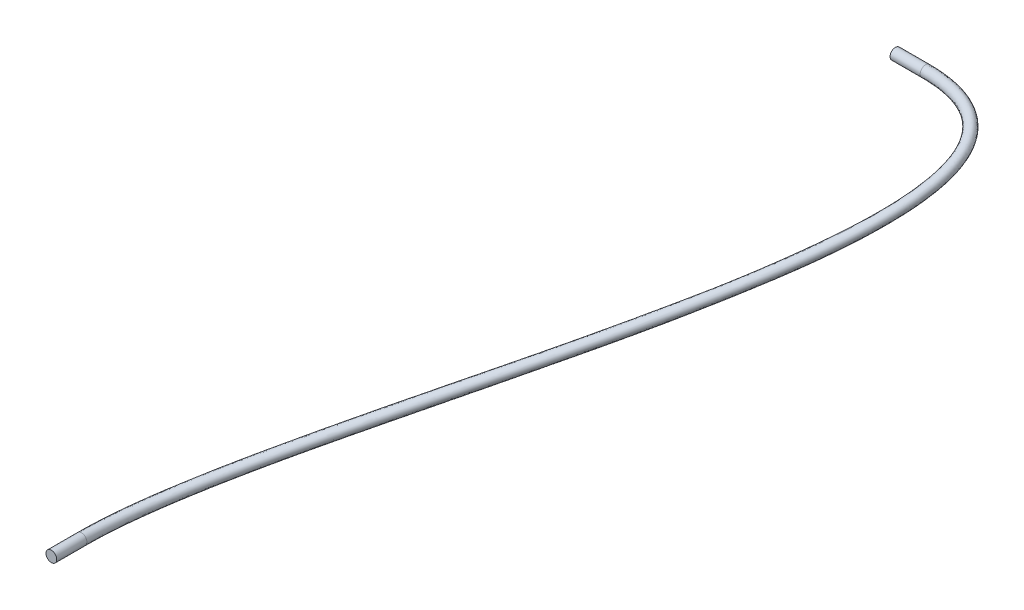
ISO-10303-21;
HEADER;
FILE_DESCRIPTION(('STEP AP214'),'2;1');
FILE_NAME('part.step','',(''),(''),'','','');
FILE_SCHEMA(('AUTOMOTIVE_DESIGN { 1 0 10303 214 1 1 1 1 }'));
ENDSEC;
DATA;
#1=APPLICATION_CONTEXT('core data for automotive mechanical design processes');
#2=APPLICATION_PROTOCOL_DEFINITION('international standard','automotive_design',2000,#1);
#3=PRODUCT_CONTEXT('',#1,'mechanical');
#4=PRODUCT('Part','Part','',(#3));
#5=PRODUCT_RELATED_PRODUCT_CATEGORY('part','',(#4));
#6=PRODUCT_DEFINITION_FORMATION('','',#4);
#7=PRODUCT_DEFINITION_CONTEXT('part definition',#1,'design');
#8=PRODUCT_DEFINITION('design','',#6,#7);
#9=PRODUCT_DEFINITION_SHAPE('','',#8);
#10=(LENGTH_UNIT() NAMED_UNIT(*) SI_UNIT(.MILLI.,.METRE.));
#11=(NAMED_UNIT(*) PLANE_ANGLE_UNIT() SI_UNIT($,.RADIAN.));
#12=(NAMED_UNIT(*) SI_UNIT($,.STERADIAN.) SOLID_ANGLE_UNIT());
#13=UNCERTAINTY_MEASURE_WITH_UNIT(LENGTH_MEASURE(1.E-05),#10,'distance_accuracy_value','');
#14=(GEOMETRIC_REPRESENTATION_CONTEXT(3) GLOBAL_UNCERTAINTY_ASSIGNED_CONTEXT((#13)) GLOBAL_UNIT_ASSIGNED_CONTEXT((#10,
#11,#12)) REPRESENTATION_CONTEXT('',''));
#15=CARTESIAN_POINT('',(0.,0.,0.));
#16=DIRECTION('',(0.,0.,1.));
#17=DIRECTION('',(1.,0.,0.));
#18=AXIS2_PLACEMENT_3D('',#15,#16,#17);
#19=CARTESIAN_POINT('',(-123.012022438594,-71.2232339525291,-87.4315353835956));
#20=DIRECTION('',(-1.,0.,0.));
#21=DIRECTION('',(0.,0.,1.));
#22=AXIS2_PLACEMENT_3D('',#19,#20,#21);
#23=CYLINDRICAL_SURFACE('',#22,1.25);
#24=CARTESIAN_POINT('',(-123.012022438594,-71.2232339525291,-87.4315353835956));
#25=DIRECTION('',(-1.,0.,0.));
#26=DIRECTION('',(0.,0.282310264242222,-0.959323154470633));
#27=AXIS2_PLACEMENT_3D('',#24,#25,#26);
#28=CIRCLE('',#27,1.25);
#29=CARTESIAN_POINT('',(-123.012022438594,-71.2232339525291,-86.1815353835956));
#30=VERTEX_POINT('',#29);
#31=EDGE_CURVE('E62',#30,#30,#28,.T.);
#32=CARTESIAN_POINT('',(-130.012022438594,-71.2232339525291,-87.4315353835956));
#33=DIRECTION('',(-1.,0.,0.));
#34=DIRECTION('',(0.,0.282310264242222,-0.959323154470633));
#35=AXIS2_PLACEMENT_3D('',#32,#33,#34);
#36=CIRCLE('',#35,1.25);
#37=CARTESIAN_POINT('',(-130.012022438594,-71.2232339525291,-86.1815353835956));
#38=VERTEX_POINT('',#37);
#39=EDGE_CURVE('E11',#38,#38,#36,.T.);
#40=CARTESIAN_POINT('',(-123.012022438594,-71.2232339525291,-86.1815353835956));
#41=CARTESIAN_POINT('',(-123.084939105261,-71.2232339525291,-86.1815353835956));
#42=CARTESIAN_POINT('',(-123.157855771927,-71.2232339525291,-86.1815353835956));
#43=CARTESIAN_POINT('',(-123.303689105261,-71.2232339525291,-86.1815353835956));
#44=CARTESIAN_POINT('',(-123.376605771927,-71.2232339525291,-86.1815353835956));
#45=CARTESIAN_POINT('',(-123.522439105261,-71.2232339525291,-86.1815353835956));
#46=CARTESIAN_POINT('',(-123.595355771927,-71.2232339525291,-86.1815353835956));
#47=CARTESIAN_POINT('',(-123.741189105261,-71.2232339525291,-86.1815353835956));
#48=CARTESIAN_POINT('',(-123.814105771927,-71.2232339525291,-86.1815353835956));
#49=CARTESIAN_POINT('',(-123.959939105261,-71.2232339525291,-86.1815353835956));
#50=CARTESIAN_POINT('',(-124.032855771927,-71.2232339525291,-86.1815353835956));
#51=CARTESIAN_POINT('',(-124.178689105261,-71.2232339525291,-86.1815353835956));
#52=CARTESIAN_POINT('',(-124.251605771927,-71.2232339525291,-86.1815353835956));
#53=CARTESIAN_POINT('',(-124.397439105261,-71.2232339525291,-86.1815353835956));
#54=CARTESIAN_POINT('',(-124.470355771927,-71.2232339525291,-86.1815353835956));
#55=CARTESIAN_POINT('',(-124.616189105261,-71.2232339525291,-86.1815353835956));
#56=CARTESIAN_POINT('',(-124.689105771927,-71.2232339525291,-86.1815353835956));
#57=CARTESIAN_POINT('',(-124.834939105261,-71.2232339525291,-86.1815353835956));
#58=CARTESIAN_POINT('',(-124.907855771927,-71.2232339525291,-86.1815353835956));
#59=CARTESIAN_POINT('',(-125.053689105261,-71.2232339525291,-86.1815353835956));
#60=CARTESIAN_POINT('',(-125.126605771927,-71.2232339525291,-86.1815353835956));
#61=CARTESIAN_POINT('',(-125.272439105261,-71.2232339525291,-86.1815353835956));
#62=CARTESIAN_POINT('',(-125.345355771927,-71.2232339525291,-86.1815353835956));
#63=CARTESIAN_POINT('',(-125.491189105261,-71.2232339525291,-86.1815353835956));
#64=CARTESIAN_POINT('',(-125.564105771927,-71.2232339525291,-86.1815353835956));
#65=CARTESIAN_POINT('',(-125.709939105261,-71.2232339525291,-86.1815353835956));
#66=CARTESIAN_POINT('',(-125.782855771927,-71.2232339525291,-86.1815353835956));
#67=CARTESIAN_POINT('',(-125.928689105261,-71.2232339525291,-86.1815353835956));
#68=CARTESIAN_POINT('',(-126.001605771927,-71.2232339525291,-86.1815353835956));
#69=CARTESIAN_POINT('',(-126.147439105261,-71.2232339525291,-86.1815353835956));
#70=CARTESIAN_POINT('',(-126.220355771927,-71.2232339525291,-86.1815353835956));
#71=CARTESIAN_POINT('',(-126.366189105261,-71.2232339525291,-86.1815353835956));
#72=CARTESIAN_POINT('',(-126.439105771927,-71.2232339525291,-86.1815353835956));
#73=CARTESIAN_POINT('',(-126.584939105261,-71.2232339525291,-86.1815353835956));
#74=CARTESIAN_POINT('',(-126.657855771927,-71.2232339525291,-86.1815353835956));
#75=CARTESIAN_POINT('',(-126.803689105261,-71.2232339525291,-86.1815353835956));
#76=CARTESIAN_POINT('',(-126.876605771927,-71.2232339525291,-86.1815353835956));
#77=CARTESIAN_POINT('',(-127.022439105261,-71.2232339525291,-86.1815353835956));
#78=CARTESIAN_POINT('',(-127.095355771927,-71.2232339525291,-86.1815353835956));
#79=CARTESIAN_POINT('',(-127.241189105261,-71.2232339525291,-86.1815353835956));
#80=CARTESIAN_POINT('',(-127.314105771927,-71.2232339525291,-86.1815353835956));
#81=CARTESIAN_POINT('',(-127.459939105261,-71.2232339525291,-86.1815353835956));
#82=CARTESIAN_POINT('',(-127.532855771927,-71.2232339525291,-86.1815353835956));
#83=CARTESIAN_POINT('',(-127.678689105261,-71.2232339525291,-86.1815353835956));
#84=CARTESIAN_POINT('',(-127.751605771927,-71.2232339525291,-86.1815353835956));
#85=CARTESIAN_POINT('',(-127.897439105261,-71.2232339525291,-86.1815353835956));
#86=CARTESIAN_POINT('',(-127.970355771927,-71.2232339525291,-86.1815353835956));
#87=CARTESIAN_POINT('',(-128.116189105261,-71.2232339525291,-86.1815353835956));
#88=CARTESIAN_POINT('',(-128.189105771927,-71.2232339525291,-86.1815353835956));
#89=CARTESIAN_POINT('',(-128.334939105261,-71.2232339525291,-86.1815353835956));
#90=CARTESIAN_POINT('',(-128.407855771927,-71.2232339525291,-86.1815353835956));
#91=CARTESIAN_POINT('',(-128.553689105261,-71.2232339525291,-86.1815353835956));
#92=CARTESIAN_POINT('',(-128.626605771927,-71.2232339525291,-86.1815353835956));
#93=CARTESIAN_POINT('',(-128.772439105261,-71.2232339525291,-86.1815353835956));
#94=CARTESIAN_POINT('',(-128.845355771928,-71.2232339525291,-86.1815353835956));
#95=CARTESIAN_POINT('',(-128.991189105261,-71.2232339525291,-86.1815353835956));
#96=CARTESIAN_POINT('',(-129.064105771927,-71.2232339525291,-86.1815353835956));
#97=CARTESIAN_POINT('',(-129.209939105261,-71.2232339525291,-86.1815353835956));
#98=CARTESIAN_POINT('',(-129.282855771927,-71.2232339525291,-86.1815353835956));
#99=CARTESIAN_POINT('',(-129.428689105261,-71.2232339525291,-86.1815353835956));
#100=CARTESIAN_POINT('',(-129.501605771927,-71.2232339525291,-86.1815353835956));
#101=CARTESIAN_POINT('',(-129.647439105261,-71.2232339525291,-86.1815353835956));
#102=CARTESIAN_POINT('',(-129.720355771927,-71.2232339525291,-86.1815353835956));
#103=CARTESIAN_POINT('',(-129.866189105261,-71.2232339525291,-86.1815353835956));
#104=CARTESIAN_POINT('',(-129.939105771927,-71.2232339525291,-86.1815353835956));
#105=CARTESIAN_POINT('',(-130.012022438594,-71.2232339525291,-86.1815353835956));
#106=B_SPLINE_CURVE_WITH_KNOTS('',3,(#40,#41,#42,#43,#44,#45,#46,#47,#48,#49,#50,#51,#52,#53,
#54,#55,#56,#57,#58,#59,#60,#61,#62,#63,#64,#65,#66,#67,#68,#69,#70,#71,#72,#73,#74,#75,#76,#77,
#78,#79,#80,#81,#82,#83,#84,#85,#86,#87,#88,#89,#90,#91,#92,#93,#94,#95,#96,#97,#98,#99,#100,
#101,#102,#103,#104,#105),.UNSPECIFIED.,.F.,.F.,(4,2,2,2,2,2,2,2,2,2,2,2,2,2,2,2,2,2,2,2,2,2,2,
2,2,2,2,2,2,2,2,2,4),(0.,0.218750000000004,0.437500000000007,0.656250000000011,
0.875000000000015,1.09375,1.31250000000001,1.53125000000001,1.75000000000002,1.96875000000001,
2.18750000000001,2.40625,2.62500000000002,2.84375000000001,3.06250000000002,3.28125000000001,
3.5,3.71875000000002,3.93750000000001,4.15625,4.37500000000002,4.59375000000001,
4.81250000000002,5.03125000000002,5.25,5.46875000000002,5.68750000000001,5.90625000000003,
6.12500000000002,6.34375000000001,6.56250000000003,6.78125000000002,7.00000000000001),.UNSPECIFIED.);
#107=EDGE_CURVE('BSEAM47',#30,#38,#106,.T.);
#108=ORIENTED_EDGE('',*,*,#31,.T.);
#109=ORIENTED_EDGE('',*,*,#39,.F.);
#110=ORIENTED_EDGE('',*,*,#107,.T.);
#111=ORIENTED_EDGE('',*,*,#107,.F.);
#112=EDGE_LOOP('',(#108,#110,#109,#111));
#113=FACE_BOUND('',#112,.T.);
#114=ADVANCED_FACE('F47',(#113),#23,.T.);
#115=CARTESIAN_POINT('',(-193.889525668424,-138.225033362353,37.6644646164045));
#116=DIRECTION('',(0.,0.,1.));
#117=DIRECTION('',(1.,0.,0.));
#118=AXIS2_PLACEMENT_3D('',#115,#116,#117);
#119=CYLINDRICAL_SURFACE('',#118,1.25);
#120=CARTESIAN_POINT('',(-193.889525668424,-138.225033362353,37.6644646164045));
#121=DIRECTION('',(0.,0.,-1.));
#122=DIRECTION('',(-1.,0.,0.));
#123=AXIS2_PLACEMENT_3D('',#120,#121,#122);
#124=CIRCLE('',#123,1.25);
#125=CARTESIAN_POINT('',(-192.639525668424,-138.225033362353,37.6644646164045));
#126=VERTEX_POINT('',#125);
#127=EDGE_CURVE('E53',#126,#126,#124,.T.);
#128=CARTESIAN_POINT('',(-193.889525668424,-138.225033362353,44.6644646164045));
#129=DIRECTION('',(0.,0.,-1.));
#130=DIRECTION('',(-1.,0.,0.));
#131=AXIS2_PLACEMENT_3D('',#128,#129,#130);
#132=CIRCLE('',#131,1.25);
#133=CARTESIAN_POINT('',(-192.639525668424,-138.225033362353,44.6644646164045));
#134=VERTEX_POINT('',#133);
#135=EDGE_CURVE('E57',#134,#134,#132,.T.);
#136=CARTESIAN_POINT('',(-192.639525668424,-138.225033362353,37.6644646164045));
#137=CARTESIAN_POINT('',(-192.639525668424,-138.225033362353,37.7373812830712));
#138=CARTESIAN_POINT('',(-192.639525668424,-138.225033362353,37.8102979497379));
#139=CARTESIAN_POINT('',(-192.639525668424,-138.225033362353,37.9561312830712));
#140=CARTESIAN_POINT('',(-192.639525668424,-138.225033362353,38.0290479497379));
#141=CARTESIAN_POINT('',(-192.639525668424,-138.225033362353,38.1748812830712));
#142=CARTESIAN_POINT('',(-192.639525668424,-138.225033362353,38.2477979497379));
#143=CARTESIAN_POINT('',(-192.639525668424,-138.225033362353,38.3936312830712));
#144=CARTESIAN_POINT('',(-192.639525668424,-138.225033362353,38.4665479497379));
#145=CARTESIAN_POINT('',(-192.639525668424,-138.225033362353,38.6123812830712));
#146=CARTESIAN_POINT('',(-192.639525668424,-138.225033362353,38.6852979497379));
#147=CARTESIAN_POINT('',(-192.639525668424,-138.225033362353,38.8311312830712));
#148=CARTESIAN_POINT('',(-192.639525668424,-138.225033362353,38.9040479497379));
#149=CARTESIAN_POINT('',(-192.639525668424,-138.225033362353,39.0498812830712));
#150=CARTESIAN_POINT('',(-192.639525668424,-138.225033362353,39.1227979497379));
#151=CARTESIAN_POINT('',(-192.639525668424,-138.225033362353,39.2686312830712));
#152=CARTESIAN_POINT('',(-192.639525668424,-138.225033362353,39.3415479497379));
#153=CARTESIAN_POINT('',(-192.639525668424,-138.225033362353,39.4873812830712));
#154=CARTESIAN_POINT('',(-192.639525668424,-138.225033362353,39.5602979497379));
#155=CARTESIAN_POINT('',(-192.639525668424,-138.225033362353,39.7061312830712));
#156=CARTESIAN_POINT('',(-192.639525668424,-138.225033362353,39.7790479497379));
#157=CARTESIAN_POINT('',(-192.639525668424,-138.225033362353,39.9248812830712));
#158=CARTESIAN_POINT('',(-192.639525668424,-138.225033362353,39.9977979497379));
#159=CARTESIAN_POINT('',(-192.639525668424,-138.225033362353,40.1436312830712));
#160=CARTESIAN_POINT('',(-192.639525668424,-138.225033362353,40.2165479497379));
#161=CARTESIAN_POINT('',(-192.639525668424,-138.225033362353,40.3623812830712));
#162=CARTESIAN_POINT('',(-192.639525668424,-138.225033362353,40.4352979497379));
#163=CARTESIAN_POINT('',(-192.639525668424,-138.225033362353,40.5811312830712));
#164=CARTESIAN_POINT('',(-192.639525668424,-138.225033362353,40.6540479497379));
#165=CARTESIAN_POINT('',(-192.639525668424,-138.225033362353,40.7998812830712));
#166=CARTESIAN_POINT('',(-192.639525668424,-138.225033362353,40.8727979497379));
#167=CARTESIAN_POINT('',(-192.639525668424,-138.225033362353,41.0186312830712));
#168=CARTESIAN_POINT('',(-192.639525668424,-138.225033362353,41.0915479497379));
#169=CARTESIAN_POINT('',(-192.639525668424,-138.225033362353,41.2373812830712));
#170=CARTESIAN_POINT('',(-192.639525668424,-138.225033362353,41.3102979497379));
#171=CARTESIAN_POINT('',(-192.639525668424,-138.225033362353,41.4561312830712));
#172=CARTESIAN_POINT('',(-192.639525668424,-138.225033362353,41.5290479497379));
#173=CARTESIAN_POINT('',(-192.639525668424,-138.225033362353,41.6748812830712));
#174=CARTESIAN_POINT('',(-192.639525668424,-138.225033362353,41.7477979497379));
#175=CARTESIAN_POINT('',(-192.639525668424,-138.225033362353,41.8936312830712));
#176=CARTESIAN_POINT('',(-192.639525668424,-138.225033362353,41.9665479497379));
#177=CARTESIAN_POINT('',(-192.639525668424,-138.225033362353,42.1123812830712));
#178=CARTESIAN_POINT('',(-192.639525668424,-138.225033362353,42.1852979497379));
#179=CARTESIAN_POINT('',(-192.639525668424,-138.225033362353,42.3311312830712));
#180=CARTESIAN_POINT('',(-192.639525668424,-138.225033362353,42.4040479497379));
#181=CARTESIAN_POINT('',(-192.639525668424,-138.225033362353,42.5498812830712));
#182=CARTESIAN_POINT('',(-192.639525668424,-138.225033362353,42.6227979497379));
#183=CARTESIAN_POINT('',(-192.639525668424,-138.225033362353,42.7686312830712));
#184=CARTESIAN_POINT('',(-192.639525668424,-138.225033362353,42.8415479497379));
#185=CARTESIAN_POINT('',(-192.639525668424,-138.225033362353,42.9873812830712));
#186=CARTESIAN_POINT('',(-192.639525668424,-138.225033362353,43.0602979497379));
#187=CARTESIAN_POINT('',(-192.639525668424,-138.225033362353,43.2061312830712));
#188=CARTESIAN_POINT('',(-192.639525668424,-138.225033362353,43.2790479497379));
#189=CARTESIAN_POINT('',(-192.639525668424,-138.225033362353,43.4248812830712));
#190=CARTESIAN_POINT('',(-192.639525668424,-138.225033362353,43.4977979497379));
#191=CARTESIAN_POINT('',(-192.639525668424,-138.225033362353,43.6436312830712));
#192=CARTESIAN_POINT('',(-192.639525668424,-138.225033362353,43.7165479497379));
#193=CARTESIAN_POINT('',(-192.639525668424,-138.225033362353,43.8623812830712));
#194=CARTESIAN_POINT('',(-192.639525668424,-138.225033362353,43.9352979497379));
#195=CARTESIAN_POINT('',(-192.639525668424,-138.225033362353,44.0811312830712));
#196=CARTESIAN_POINT('',(-192.639525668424,-138.225033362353,44.1540479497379));
#197=CARTESIAN_POINT('',(-192.639525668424,-138.225033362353,44.2998812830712));
#198=CARTESIAN_POINT('',(-192.639525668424,-138.225033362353,44.3727979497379));
#199=CARTESIAN_POINT('',(-192.639525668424,-138.225033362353,44.5186312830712));
#200=CARTESIAN_POINT('',(-192.639525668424,-138.225033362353,44.5915479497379));
#201=CARTESIAN_POINT('',(-192.639525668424,-138.225033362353,44.6644646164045));
#202=B_SPLINE_CURVE_WITH_KNOTS('',3,(#136,#137,#138,#139,#140,#141,#142,#143,#144,#145,#146,
#147,#148,#149,#150,#151,#152,#153,#154,#155,#156,#157,#158,#159,#160,#161,#162,#163,#164,#165,
#166,#167,#168,#169,#170,#171,#172,#173,#174,#175,#176,#177,#178,#179,#180,#181,#182,#183,#184,
#185,#186,#187,#188,#189,#190,#191,#192,#193,#194,#195,#196,#197,#198,#199,#200,#201),
.UNSPECIFIED.,.F.,.F.,(4,2,2,2,2,2,2,2,2,2,2,2,2,2,2,2,2,2,2,2,2,2,2,2,2,2,2,2,2,2,2,2,4),(0.,
0.218750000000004,0.4375,0.656250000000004,0.875000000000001,1.09375,1.3125,1.53125,1.75,
1.96875000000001,2.1875,2.40625000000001,2.625,2.84375000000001,3.0625,3.28125,3.5,3.71875,
3.9375,4.15625,4.375,4.59375,4.8125,5.03125,5.25,5.46875,5.68750000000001,5.90625,
6.12500000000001,6.34375,6.5625,6.78125,7.),.UNSPECIFIED.);
#203=EDGE_CURVE('BSEAM81',#126,#134,#202,.T.);
#204=ORIENTED_EDGE('',*,*,#127,.F.);
#205=ORIENTED_EDGE('',*,*,#135,.T.);
#206=ORIENTED_EDGE('',*,*,#203,.T.);
#207=ORIENTED_EDGE('',*,*,#203,.F.);
#208=EDGE_LOOP('',(#204,#206,#205,#207));
#209=FACE_BOUND('',#208,.T.);
#210=ADVANCED_FACE('F81',(#209),#119,.T.);
#211=CARTESIAN_POINT('',(-193.889525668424,-138.225033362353,44.6644646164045));
#212=DIRECTION('',(0.,0.,-1.));
#213=DIRECTION('',(-1.,0.,0.));
#214=AXIS2_PLACEMENT_3D('',#211,#212,#213);
#215=PLANE('',#214);
#216=ORIENTED_EDGE('',*,*,#135,.F.);
#217=EDGE_LOOP('',(#216));
#218=FACE_BOUND('',#217,.T.);
#219=ADVANCED_FACE('F76',(#218),#215,.F.);
#220=CARTESIAN_POINT('',(-130.012022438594,-71.2232339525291,-87.4315353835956));
#221=DIRECTION('',(-1.,0.,0.));
#222=DIRECTION('',(0.,0.282310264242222,-0.959323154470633));
#223=AXIS2_PLACEMENT_3D('',#220,#221,#222);
#224=PLANE('',#223);
#225=ORIENTED_EDGE('',*,*,#39,.T.);
#226=EDGE_LOOP('',(#225));
#227=FACE_BOUND('',#226,.T.);
#228=ADVANCED_FACE('F71',(#227),#224,.T.);
#229=CARTESIAN_POINT('',(-195.139525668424,-138.225033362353,37.6644646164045));
#230=CARTESIAN_POINT('',(-195.139525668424,-138.225033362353,34.7476737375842));
#231=CARTESIAN_POINT('',(-194.406398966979,-137.857630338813,28.505824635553));
#232=CARTESIAN_POINT('',(-191.424791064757,-136.294005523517,19.3451536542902));
#233=CARTESIAN_POINT('',(-186.864834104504,-133.863548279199,10.0822324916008));
#234=CARTESIAN_POINT('',(-176.806733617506,-128.438528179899,-5.71798844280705));
#235=CARTESIAN_POINT('',(-160.553122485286,-119.214977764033,-24.302903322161));
#236=CARTESIAN_POINT('',(-139.915160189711,-107.779324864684,-44.0373880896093));
#237=CARTESIAN_POINT('',(-124.795471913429,-98.0456117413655,-57.0086679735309));
#238=CARTESIAN_POINT('',(-114.336799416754,-89.3090671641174,-67.7710125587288));
#239=CARTESIAN_POINT('',(-109.359875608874,-83.7209168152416,-74.3770646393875));
#240=CARTESIAN_POINT('',(-107.459989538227,-80.0613495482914,-78.5800781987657));
#241=CARTESIAN_POINT('',(-106.990567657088,-78.1090643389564,-80.7880463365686));
#242=CARTESIAN_POINT('',(-107.1055331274,-76.5127538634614,-82.5706946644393));
#243=CARTESIAN_POINT('',(-107.609697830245,-75.233523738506,-83.9845842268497));
#244=CARTESIAN_POINT('',(-108.504424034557,-74.1381725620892,-85.1823339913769));
#245=CARTESIAN_POINT('',(-109.708009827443,-73.2398060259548,-86.1546125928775));
#246=CARTESIAN_POINT('',(-111.130260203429,-72.5251454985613,-86.9201978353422));
#247=CARTESIAN_POINT('',(-112.829628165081,-71.9418052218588,-87.5383148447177));
#248=CARTESIAN_POINT('',(-115.187890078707,-71.3979975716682,-88.1064917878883));
#249=CARTESIAN_POINT('',(-118.410946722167,-70.9885724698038,-88.5277250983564));
#250=CARTESIAN_POINT('',(-121.427315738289,-70.8703461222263,-88.6306893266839));
#251=CARTESIAN_POINT('',(-123.012022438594,-70.8703461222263,-88.6306893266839));
#252=CARTESIAN_POINT('',(-195.139525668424,-135.725033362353,37.6644646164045));
#253=CARTESIAN_POINT('',(-195.139525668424,-135.725033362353,35.0199809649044));
#254=CARTESIAN_POINT('',(-194.462199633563,-135.371066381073,28.7226061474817));
#255=CARTESIAN_POINT('',(-191.581996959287,-133.844477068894,19.8486349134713));
#256=CARTESIAN_POINT('',(-187.141011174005,-131.447633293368,10.6745444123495));
#257=CARTESIAN_POINT('',(-177.318590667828,-126.092561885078,-5.05800673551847));
#258=CARTESIAN_POINT('',(-161.296592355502,-116.737441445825,-23.5626491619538));
#259=CARTESIAN_POINT('',(-142.049924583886,-106.134778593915,-45.0862182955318));
#260=CARTESIAN_POINT('',(-126.436201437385,-98.578624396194,-59.0251789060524));
#261=CARTESIAN_POINT('',(-115.606809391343,-90.2968067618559,-69.6583079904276));
#262=CARTESIAN_POINT('',(-110.578913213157,-84.942650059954,-76.1962075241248));
#263=CARTESIAN_POINT('',(-108.690757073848,-81.4798886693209,-80.2334733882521));
#264=CARTESIAN_POINT('',(-108.228974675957,-79.6812042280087,-82.2931709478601));
#265=CARTESIAN_POINT('',(-108.313317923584,-78.2630670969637,-83.8927362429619));
#266=CARTESIAN_POINT('',(-108.73563507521,-77.1622692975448,-85.1204706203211));
#267=CARTESIAN_POINT('',(-109.481734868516,-76.2349143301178,-86.1435965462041));
#268=CARTESIAN_POINT('',(-110.500509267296,-75.4644451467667,-86.9857017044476));
#269=CARTESIAN_POINT('',(-111.74078529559,-74.8337832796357,-87.669272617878));
#270=CARTESIAN_POINT('',(-113.270256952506,-74.3017310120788,-88.2413489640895));
#271=CARTESIAN_POINT('',(-115.465453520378,-73.7903646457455,-88.7869556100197));
#272=CARTESIAN_POINT('',(-118.48907620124,-73.3933987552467,-89.205990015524));
#273=CARTESIAN_POINT('',(-121.547682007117,-73.2686540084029,-89.3364649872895));
#274=CARTESIAN_POINT('',(-123.012022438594,-73.2686540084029,-89.3364649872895));
#275=CARTESIAN_POINT('',(-192.639525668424,-135.725033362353,37.6644646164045));
#276=CARTESIAN_POINT('',(-192.639525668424,-135.725033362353,35.0199809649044));
#277=CARTESIAN_POINT('',(-192.011707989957,-135.36717758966,29.3850364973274));
#278=CARTESIAN_POINT('',(-189.265706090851,-133.876400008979,20.7831081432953));
#279=CARTESIAN_POINT('',(-184.958059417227,-131.498326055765,11.9132173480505));
#280=CARTESIAN_POINT('',(-175.369902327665,-126.090159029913,-3.50283929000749));
#281=CARTESIAN_POINT('',(-159.349056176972,-116.707230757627,-21.7053660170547));
#282=CARTESIAN_POINT('',(-141.451027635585,-104.101455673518,-43.1182307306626));
#283=CARTESIAN_POINT('',(-127.699992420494,-96.2814348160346,-58.6066426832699));
#284=CARTESIAN_POINT('',(-117.219163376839,-88.4124736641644,-69.5609270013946));
#285=CARTESIAN_POINT('',(-112.473674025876,-83.2879893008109,-76.0603975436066));
#286=CARTESIAN_POINT('',(-110.784697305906,-80.1615186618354,-79.8199287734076));
#287=CARTESIAN_POINT('',(-110.414356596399,-78.6468646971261,-81.6010757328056));
#288=CARTESIAN_POINT('',(-110.492944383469,-77.5714455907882,-82.8463238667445));
#289=CARTESIAN_POINT('',(-110.795383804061,-76.8189792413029,-83.7088680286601));
#290=CARTESIAN_POINT('',(-111.284582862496,-76.2240735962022,-84.3849365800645));
#291=CARTESIAN_POINT('',(-111.97077977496,-75.7118784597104,-84.9625477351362));
#292=CARTESIAN_POINT('',(-112.877015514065,-75.2572187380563,-85.4721513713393));
#293=CARTESIAN_POINT('',(-114.098169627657,-74.8404380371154,-85.9372679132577));
#294=CARTESIAN_POINT('',(-115.970424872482,-74.4156382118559,-86.4131563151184));
#295=CARTESIAN_POINT('',(-118.746073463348,-74.065402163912,-86.8032576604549));
#296=CARTESIAN_POINT('',(-121.547682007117,-73.9744296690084,-86.9381571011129));
#297=CARTESIAN_POINT('',(-123.012022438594,-73.9744296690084,-86.9381571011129));
#298=CARTESIAN_POINT('',(-192.639525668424,-138.225033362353,37.6644646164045));
#299=CARTESIAN_POINT('',(-192.639525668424,-138.225033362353,34.8838273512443));
#300=CARTESIAN_POINT('',(-191.95590732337,-137.853741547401,29.1050785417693));
#301=CARTESIAN_POINT('',(-189.108500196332,-136.325928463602,20.296514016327));
#302=CARTESIAN_POINT('',(-184.681882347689,-133.914241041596,11.3165333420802));
#303=CARTESIAN_POINT('',(-174.858045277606,-128.436125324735,-4.15866743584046));
#304=CARTESIAN_POINT('',(-158.605586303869,-119.184767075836,-22.4465833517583));
#305=CARTESIAN_POINT('',(-139.316263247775,-105.746001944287,-42.0691910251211));
#306=CARTESIAN_POINT('',(-126.059262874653,-95.7484221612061,-56.5901747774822));
#307=CARTESIAN_POINT('',(-115.94915346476,-87.4247340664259,-67.6736209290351));
#308=CARTESIAN_POINT('',(-111.25463624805,-82.0662560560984,-74.241255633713));
#309=CARTESIAN_POINT('',(-109.55392999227,-78.742979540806,-78.1665334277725));
#310=CARTESIAN_POINT('',(-109.175948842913,-77.0747248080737,-80.0959511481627));
#311=CARTESIAN_POINT('',(-109.285161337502,-75.8211323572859,-81.5242822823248));
#312=CARTESIAN_POINT('',(-109.669439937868,-74.8902336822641,-82.572981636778));
#313=CARTESIAN_POINT('',(-110.307295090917,-74.1273318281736,-83.4236740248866));
#314=CARTESIAN_POINT('',(-111.178209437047,-73.4872393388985,-84.131458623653));
#315=CARTESIAN_POINT('',(-112.266756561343,-72.9485809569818,-84.7230765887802));
#316=CARTESIAN_POINT('',(-113.656547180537,-72.4805122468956,-85.2342337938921));
#317=CARTESIAN_POINT('',(-115.697465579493,-72.0232711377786,-85.7326924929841));
#318=CARTESIAN_POINT('',(-118.639534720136,-71.6605758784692,-86.1249927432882));
#319=CARTESIAN_POINT('',(-121.487498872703,-71.5761217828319,-86.2323814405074));
#320=CARTESIAN_POINT('',(-123.012022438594,-71.5761217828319,-86.2323814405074));
#321=CARTESIAN_POINT('',(-192.639525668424,-140.725033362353,37.6644646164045));
#322=CARTESIAN_POINT('',(-192.639525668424,-140.725033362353,34.7476737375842));
#323=CARTESIAN_POINT('',(-191.900106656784,-140.340305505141,28.8251205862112));
#324=CARTESIAN_POINT('',(-188.951294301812,-138.775456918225,19.8099198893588));
#325=CARTESIAN_POINT('',(-184.405705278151,-136.330156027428,10.7198493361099));
#326=CARTESIAN_POINT('',(-174.346188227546,-130.782091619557,-4.81449558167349));
#327=CARTESIAN_POINT('',(-157.862116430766,-121.662303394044,-23.1878006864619));
#328=CARTESIAN_POINT('',(-137.181498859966,-107.390548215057,-41.0201513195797));
#329=CARTESIAN_POINT('',(-124.418533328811,-95.2154095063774,-54.5737068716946));
#330=CARTESIAN_POINT('',(-114.679143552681,-86.4369944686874,-65.7863148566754));
#331=CARTESIAN_POINT('',(-110.035598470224,-80.844522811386,-72.4221137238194));
#332=CARTESIAN_POINT('',(-108.323162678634,-77.3244404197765,-76.5131380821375));
#333=CARTESIAN_POINT('',(-107.937541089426,-75.5025849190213,-78.5908265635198));
#334=CARTESIAN_POINT('',(-108.077378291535,-74.0708191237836,-80.2022406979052));
#335=CARTESIAN_POINT('',(-108.543496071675,-72.9614881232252,-81.4370952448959));
#336=CARTESIAN_POINT('',(-109.330007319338,-72.030590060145,-82.4624114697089));
#337=CARTESIAN_POINT('',(-110.385639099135,-71.2626002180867,-83.3003695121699));
#338=CARTESIAN_POINT('',(-111.656497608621,-70.6399431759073,-83.9740018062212));
#339=CARTESIAN_POINT('',(-113.214924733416,-70.1205864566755,-84.5311996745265));
#340=CARTESIAN_POINT('',(-115.424506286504,-69.6309040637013,-85.0522286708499));
#341=CARTESIAN_POINT('',(-118.532995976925,-69.2557495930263,-85.4467278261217));
#342=CARTESIAN_POINT('',(-121.427315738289,-69.1778138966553,-85.5266057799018));
#343=CARTESIAN_POINT('',(-123.012022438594,-69.1778138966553,-85.5266057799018));
#344=CARTESIAN_POINT('',(-195.139525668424,-140.725033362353,37.6644646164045));
#345=CARTESIAN_POINT('',(-195.139525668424,-140.725033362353,34.4753665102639));
#346=CARTESIAN_POINT('',(-194.350598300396,-140.344194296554,28.2890431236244));
#347=CARTESIAN_POINT('',(-191.267585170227,-138.74353397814,18.8416723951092));
#348=CARTESIAN_POINT('',(-186.588657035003,-136.27946326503,9.48992057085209));
#349=CARTESIAN_POINT('',(-176.294876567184,-130.784494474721,-6.3779701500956));
#350=CARTESIAN_POINT('',(-159.809652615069,-121.692514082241,-25.0431574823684));
#351=CARTESIAN_POINT('',(-137.780395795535,-109.423871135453,-42.9885578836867));
#352=CARTESIAN_POINT('',(-123.154742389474,-97.5125990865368,-54.9921570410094));
#353=CARTESIAN_POINT('',(-113.066789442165,-88.321327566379,-65.8837171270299));
#354=CARTESIAN_POINT('',(-108.140838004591,-82.4991835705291,-72.5579217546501));
#355=CARTESIAN_POINT('',(-106.229222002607,-78.642810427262,-76.9266830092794));
#356=CARTESIAN_POINT('',(-105.75216063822,-76.536924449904,-79.282921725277));
#357=CARTESIAN_POINT('',(-105.897748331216,-74.7624406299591,-81.2486530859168));
#358=CARTESIAN_POINT('',(-106.48376058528,-73.304778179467,-82.8486978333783));
#359=CARTESIAN_POINT('',(-107.527113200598,-72.0414307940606,-84.2210714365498));
#360=CARTESIAN_POINT('',(-108.915510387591,-71.015166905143,-85.3235234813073));
#361=CARTESIAN_POINT('',(-110.519735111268,-70.2165077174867,-86.1711230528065));
#362=CARTESIAN_POINT('',(-112.388999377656,-69.5818794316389,-86.8352807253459));
#363=CARTESIAN_POINT('',(-114.910326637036,-69.0056304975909,-87.4260279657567));
#364=CARTESIAN_POINT('',(-118.332817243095,-68.583746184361,-87.849460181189));
#365=CARTESIAN_POINT('',(-121.306949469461,-68.4720382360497,-87.9249136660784));
#366=CARTESIAN_POINT('',(-123.012022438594,-68.4720382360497,-87.9249136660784));
#367=CARTESIAN_POINT('',(-195.139525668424,-138.225033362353,37.6644646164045));
#368=CARTESIAN_POINT('',(-195.139525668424,-138.225033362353,34.7476737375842));
#369=CARTESIAN_POINT('',(-194.406398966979,-137.857630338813,28.505824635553));
#370=CARTESIAN_POINT('',(-191.424791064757,-136.294005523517,19.3451536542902));
#371=CARTESIAN_POINT('',(-186.864834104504,-133.863548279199,10.0822324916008));
#372=CARTESIAN_POINT('',(-176.806733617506,-128.438528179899,-5.71798844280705));
#373=CARTESIAN_POINT('',(-160.553122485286,-119.214977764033,-24.302903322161));
#374=CARTESIAN_POINT('',(-139.915160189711,-107.779324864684,-44.0373880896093));
#375=CARTESIAN_POINT('',(-124.795471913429,-98.0456117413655,-57.0086679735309));
#376=CARTESIAN_POINT('',(-114.336799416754,-89.3090671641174,-67.7710125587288));
#377=CARTESIAN_POINT('',(-109.359875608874,-83.7209168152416,-74.3770646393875));
#378=CARTESIAN_POINT('',(-107.459989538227,-80.0613495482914,-78.5800781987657));
#379=CARTESIAN_POINT('',(-106.990567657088,-78.1090643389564,-80.7880463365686));
#380=CARTESIAN_POINT('',(-107.1055331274,-76.5127538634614,-82.5706946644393));
#381=CARTESIAN_POINT('',(-107.609697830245,-75.233523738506,-83.9845842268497));
#382=CARTESIAN_POINT('',(-108.504424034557,-74.1381725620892,-85.1823339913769));
#383=CARTESIAN_POINT('',(-109.708009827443,-73.2398060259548,-86.1546125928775));
#384=CARTESIAN_POINT('',(-111.130260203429,-72.5251454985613,-86.9201978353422));
#385=CARTESIAN_POINT('',(-112.829628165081,-71.9418052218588,-87.5383148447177));
#386=CARTESIAN_POINT('',(-115.187890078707,-71.3979975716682,-88.1064917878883));
#387=CARTESIAN_POINT('',(-118.410946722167,-70.9885724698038,-88.5277250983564));
#388=CARTESIAN_POINT('',(-121.427315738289,-70.8703461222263,-88.6306893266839));
#389=CARTESIAN_POINT('',(-123.012022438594,-70.8703461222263,-88.6306893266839));
#390=(BOUNDED_SURFACE() B_SPLINE_SURFACE(3,3,((#229,#230,#231,#232,#233,#234,#235,#236,#237,
#238,#239,#240,#241,#242,#243,#244,#245,#246,#247,#248,#249,#250,#251),(#252,#253,#254,#255,
#256,#257,#258,#259,#260,#261,#262,#263,#264,#265,#266,#267,#268,#269,#270,#271,#272,#273,#274),
(#275,#276,#277,#278,#279,#280,#281,#282,#283,#284,#285,#286,#287,#288,#289,#290,#291,#292,#293,
#294,#295,#296,#297),(#298,#299,#300,#301,#302,#303,#304,#305,#306,#307,#308,#309,#310,#311,
#312,#313,#314,#315,#316,#317,#318,#319,#320),(#321,#322,#323,#324,#325,#326,#327,#328,#329,
#330,#331,#332,#333,#334,#335,#336,#337,#338,#339,#340,#341,#342,#343),(#344,#345,#346,#347,
#348,#349,#350,#351,#352,#353,#354,#355,#356,#357,#358,#359,#360,#361,#362,#363,#364,#365,#366),
(#367,#368,#369,#370,#371,#372,#373,#374,#375,#376,#377,#378,#379,#380,#381,#382,#383,#384,#385,
#386,#387,#388,#389)),.UNSPECIFIED.,.T.,.F.,.F.) B_SPLINE_SURFACE_WITH_KNOTS((4,3,4),(4,1,1,1,1,
1,1,1,1,1,1,1,1,1,1,1,1,1,1,1,4),(0.,0.5,1.),(0.,0.0525,0.105,0.1575,0.21,0.375,
0.479999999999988,0.585,0.6675,0.75,0.78125,0.8125,0.833333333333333,0.854166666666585,0.875,
0.8925,0.91,0.9275,0.945,0.9725,1.),
.UNSPECIFIED.) GEOMETRIC_REPRESENTATION_ITEM() RATIONAL_B_SPLINE_SURFACE(((1.,1.,1.,1.,1.,1.,1.,
1.,1.,1.,1.,1.,1.,1.,1.,1.,1.,1.,1.,1.,1.,1.,1.),(0.333333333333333,0.333333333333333,
0.333333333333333,0.333333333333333,0.333333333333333,0.333333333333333,0.333333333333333,
0.333333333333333,0.333333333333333,0.333333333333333,0.333333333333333,0.333333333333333,
0.333333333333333,0.333333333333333,0.333333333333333,0.333333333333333,0.333333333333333,
0.333333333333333,0.333333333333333,0.333333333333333,0.333333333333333,0.333333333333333,
0.333333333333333),(0.333333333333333,0.333333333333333,0.333333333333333,0.333333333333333,
0.333333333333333,0.333333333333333,0.333333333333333,0.333333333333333,0.333333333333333,
0.333333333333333,0.333333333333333,0.333333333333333,0.333333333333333,0.333333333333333,
0.333333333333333,0.333333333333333,0.333333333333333,0.333333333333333,0.333333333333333,
0.333333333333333,0.333333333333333,0.333333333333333,0.333333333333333),(1.,1.,1.,1.,1.,1.,1.,
1.,1.,1.,1.,1.,1.,1.,1.,1.,1.,1.,1.,1.,1.,1.,1.),(0.333333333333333,0.333333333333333,
0.333333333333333,0.333333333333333,0.333333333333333,0.333333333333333,0.333333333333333,
0.333333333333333,0.333333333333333,0.333333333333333,0.333333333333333,0.333333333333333,
0.333333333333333,0.333333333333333,0.333333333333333,0.333333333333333,0.333333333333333,
0.333333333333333,0.333333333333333,0.333333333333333,0.333333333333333,0.333333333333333,
0.333333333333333),(0.333333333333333,0.333333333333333,0.333333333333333,0.333333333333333,
0.333333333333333,0.333333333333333,0.333333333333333,0.333333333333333,0.333333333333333,
0.333333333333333,0.333333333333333,0.333333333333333,0.333333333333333,0.333333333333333,
0.333333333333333,0.333333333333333,0.333333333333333,0.333333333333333,0.333333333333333,
0.333333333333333,0.333333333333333,0.333333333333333,0.333333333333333),(1.,1.,1.,1.,1.,1.,1.,
1.,1.,1.,1.,1.,1.,1.,1.,1.,1.,1.,1.,1.,1.,1.,1.))) REPRESENTATION_ITEM('') SURFACE());
#391=ORIENTED_EDGE('',*,*,#127,.T.);
#392=EDGE_LOOP('',(#391));
#393=FACE_BOUND('',#392,.T.);
#394=ORIENTED_EDGE('',*,*,#31,.F.);
#395=EDGE_LOOP('',(#394));
#396=FACE_BOUND('',#395,.T.);
#397=ADVANCED_FACE('F69',(#393,#396),#390,.T.);
#398=CLOSED_SHELL('',(#114,#210,#219,#228,#397));
#399=MANIFOLD_SOLID_BREP('B2',#398);
#400=ADVANCED_BREP_SHAPE_REPRESENTATION('',(#18,#399),#14);
#401=SHAPE_DEFINITION_REPRESENTATION(#9,#400);
ENDSEC;
END-ISO-10303-21;
